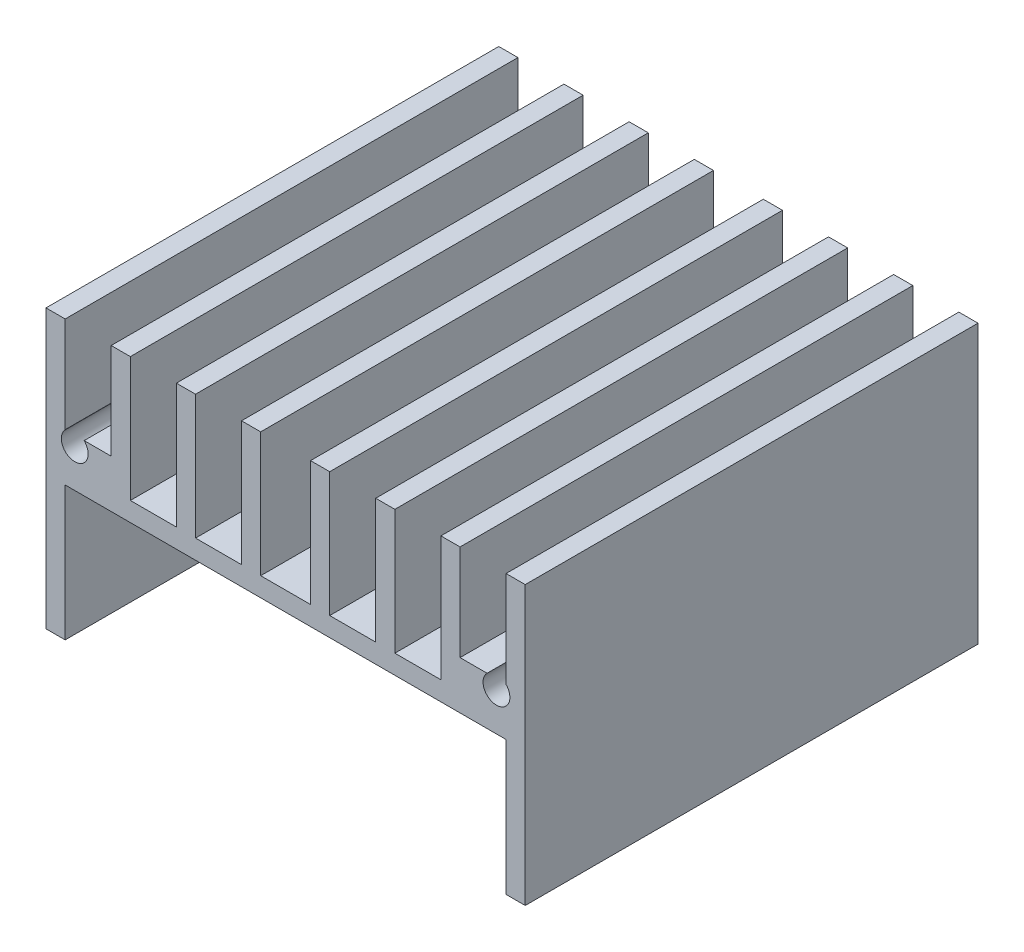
from build123d import *

# Parameters (mm, degrees)
EXTRUDE_1_DEPTH     = 29.9974
SKETCH_3_W          = 3.048
SKETCH_3_H          = 29.9974
EXTRUDE_3_DEPTH     = 1.905
SKETCH_5_R          = 1.4986
CUT_EXTRUDE_1_DEPTH = 1.27
SKETCH_4_R          = 0.889
CUT_EXTRUDE1_DEPTH  = 29.9974


with BuildPart() as part:
    # Sketch 1 → Extrude 1 (new body)
    with BuildSketch(Plane.XY):
        Polygon((-15.875, -11.43), (-15.875, 6.985), (-14.605, 6.985), (-14.605, -1.27), (-11.557, -1.27), (-11.557, 6.985), (-10.287, 6.985), (-10.287, -1.27), (-7.239, -1.27), (-7.239, 6.985), (-5.969, 6.985), (-5.969, -1.27), (-2.921, -1.27), (-2.921, 6.985), (-1.651, 6.985), (-1.651, -1.27), (1.651, -1.27), (1.651, 6.985), (2.921, 6.985), (2.921, -1.27), (5.969, -1.27), (5.969, 6.985), (7.239, 6.985), (7.239, -1.27), (10.287, -1.27), (10.287, 6.985), (11.557, 6.985), (11.557, -1.27), (14.605, -1.27), (14.605, 6.985), (15.875, 6.985), (15.875, -11.43), (14.605, -11.43), (14.605, -2.54), (-14.605, -2.54), (-14.605, -11.43), align=None)
    extrude(amount=EXTRUDE_1_DEPTH)

    # Sketch 3 → Extrude 3 (add)
    with BuildSketch(Plane(origin=(0, -1.27, 0), x_dir=(1, 0, 0), z_dir=(0, 1, 0))):
        with Locations((-13.081, -14.9987)):
            Rectangle(SKETCH_3_W, SKETCH_3_H)
        with Locations((13.081, -14.9987)):
            Rectangle(SKETCH_3_W, SKETCH_3_H)
    extrude(amount=EXTRUDE_3_DEPTH)

    # Sketch 5 → Cut-Extrude 1 (cut)
    with BuildSketch(Plane.XZ.offset(2.54)):
        with Locations(Location((-8.89, 19.9898, 0), (0, 0, 270))):
            Circle(SKETCH_5_R)
        with Locations(Location((8.89, 19.9898, 0), (0, 0, 270))):
            Circle(SKETCH_5_R)
    extrude(amount=-CUT_EXTRUDE_1_DEPTH, mode=Mode.SUBTRACT)

    # Sketch 4 → Cut-Extrude1 (cut)
    with BuildSketch(Plane(origin=(0, 0, 0), x_dir=(-1, 0, 0), z_dir=(0, 0, -1))):
        with Locations((13.97, 0)):
            Circle(SKETCH_4_R)
        with Locations((-13.97, 0)):
            Circle(SKETCH_4_R)
    extrude(amount=-CUT_EXTRUDE1_DEPTH, mode=Mode.SUBTRACT)


solid = part.part
